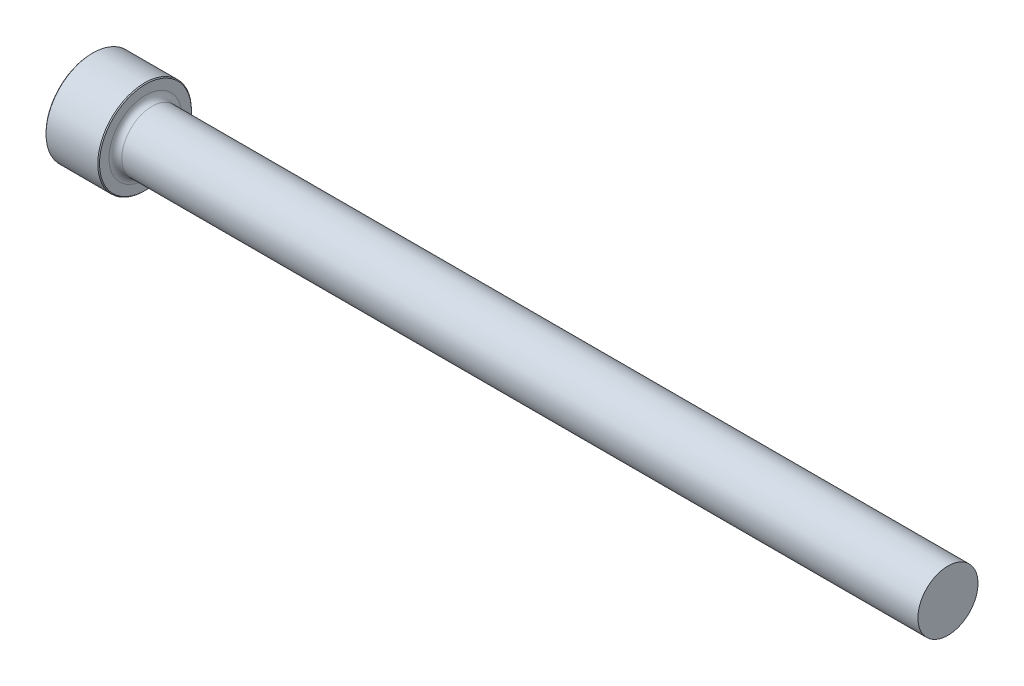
ISO-10303-21;
HEADER;
FILE_DESCRIPTION(('STEP AP214'),'2;1');
FILE_NAME('part.step','',(''),(''),'','','');
FILE_SCHEMA(('AUTOMOTIVE_DESIGN { 1 0 10303 214 1 1 1 1 }'));
ENDSEC;
DATA;
#1=APPLICATION_CONTEXT('core data for automotive mechanical design processes');
#2=APPLICATION_PROTOCOL_DEFINITION('international standard','automotive_design',2000,#1);
#3=PRODUCT_CONTEXT('',#1,'mechanical');
#4=PRODUCT('Part','Part','',(#3));
#5=PRODUCT_RELATED_PRODUCT_CATEGORY('part','',(#4));
#6=PRODUCT_DEFINITION_FORMATION('','',#4);
#7=PRODUCT_DEFINITION_CONTEXT('part definition',#1,'design');
#8=PRODUCT_DEFINITION('design','',#6,#7);
#9=PRODUCT_DEFINITION_SHAPE('','',#8);
#10=(LENGTH_UNIT() NAMED_UNIT(*) SI_UNIT(.MILLI.,.METRE.));
#11=(NAMED_UNIT(*) PLANE_ANGLE_UNIT() SI_UNIT($,.RADIAN.));
#12=(NAMED_UNIT(*) SI_UNIT($,.STERADIAN.) SOLID_ANGLE_UNIT());
#13=UNCERTAINTY_MEASURE_WITH_UNIT(LENGTH_MEASURE(1.E-05),#10,'distance_accuracy_value','');
#14=(GEOMETRIC_REPRESENTATION_CONTEXT(3) GLOBAL_UNCERTAINTY_ASSIGNED_CONTEXT((#13)) GLOBAL_UNIT_ASSIGNED_CONTEXT((#10,
#11,#12)) REPRESENTATION_CONTEXT('',''));
#15=CARTESIAN_POINT('',(0.,0.,0.));
#16=DIRECTION('',(0.,0.,1.));
#17=DIRECTION('',(1.,0.,0.));
#18=AXIS2_PLACEMENT_3D('',#15,#16,#17);
#19=CARTESIAN_POINT('',(101.6,3.56806499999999,0.));
#20=DIRECTION('',(1.,0.,0.));
#21=DIRECTION('',(0.,1.,0.));
#22=AXIS2_PLACEMENT_3D('',#19,#20,#21);
#23=PLANE('',#22);
#24=CARTESIAN_POINT('',(101.6,0.,0.));
#25=DIRECTION('',(1.,0.,0.));
#26=DIRECTION('',(0.,1.,0.));
#27=AXIS2_PLACEMENT_3D('',#24,#25,#26);
#28=CIRCLE('',#27,3.568065);
#29=CARTESIAN_POINT('',(101.6,3.56806499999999,0.));
#30=VERTEX_POINT('',#29);
#31=EDGE_CURVE('E50',#30,#30,#28,.T.);
#32=ORIENTED_EDGE('',*,*,#31,.T.);
#33=EDGE_LOOP('',(#32));
#34=FACE_BOUND('',#33,.T.);
#35=ADVANCED_FACE('F30',(#34),#23,.T.);
#36=CARTESIAN_POINT('',(101.6,0.,0.));
#37=DIRECTION('',(1.,0.,0.));
#38=DIRECTION('',(0.,1.,0.));
#39=AXIS2_PLACEMENT_3D('',#36,#37,#38);
#40=CYLINDRICAL_SURFACE('',#39,3.568065);
#41=CARTESIAN_POINT('',(7.11199999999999,0.,0.));
#42=DIRECTION('',(1.,0.,0.));
#43=DIRECTION('',(0.,1.,0.));
#44=AXIS2_PLACEMENT_3D('',#41,#42,#43);
#45=CIRCLE('',#44,3.56806499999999);
#46=CARTESIAN_POINT('',(7.11199999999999,3.56806499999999,0.));
#47=VERTEX_POINT('',#46);
#48=EDGE_CURVE('E53',#47,#47,#45,.T.);
#49=ORIENTED_EDGE('',*,*,#48,.T.);
#50=EDGE_LOOP('',(#49));
#51=FACE_BOUND('',#50,.T.);
#52=ORIENTED_EDGE('',*,*,#31,.F.);
#53=EDGE_LOOP('',(#52));
#54=FACE_BOUND('',#53,.T.);
#55=ADVANCED_FACE('F74',(#51,#54),#40,.T.);
#56=CARTESIAN_POINT('',(7.112,0.,0.));
#57=DIRECTION('',(1.,0.,0.));
#58=DIRECTION('',(0.,1.,0.));
#59=AXIS2_PLACEMENT_3D('',#56,#57,#58);
#60=TOROIDAL_SURFACE('',#59,4.33006499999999,0.762);
#61=CARTESIAN_POINT('',(6.34999999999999,0.,0.));
#62=DIRECTION('',(1.,0.,0.));
#63=DIRECTION('',(0.,1.,0.));
#64=AXIS2_PLACEMENT_3D('',#61,#62,#63);
#65=CIRCLE('',#64,4.33006499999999);
#66=CARTESIAN_POINT('',(6.34999999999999,4.33006499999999,0.));
#67=VERTEX_POINT('',#66);
#68=EDGE_CURVE('E56',#67,#67,#65,.T.);
#69=ORIENTED_EDGE('',*,*,#68,.T.);
#70=EDGE_LOOP('',(#69));
#71=FACE_BOUND('',#70,.T.);
#72=ORIENTED_EDGE('',*,*,#48,.F.);
#73=EDGE_LOOP('',(#72));
#74=FACE_BOUND('',#73,.T.);
#75=ADVANCED_FACE('F60',(#71,#74),#60,.F.);
#76=CARTESIAN_POINT('',(6.35,5.55625,0.));
#77=DIRECTION('',(1.,0.,0.));
#78=DIRECTION('',(0.,1.,0.));
#79=AXIS2_PLACEMENT_3D('',#76,#77,#78);
#80=PLANE('',#79);
#81=CARTESIAN_POINT('',(6.35,0.,0.));
#82=DIRECTION('',(1.,0.,0.));
#83=DIRECTION('',(0.,1.,0.));
#84=AXIS2_PLACEMENT_3D('',#81,#82,#83);
#85=CIRCLE('',#84,5.45465000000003);
#86=CARTESIAN_POINT('',(6.35,5.45465000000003,0.));
#87=VERTEX_POINT('',#86);
#88=EDGE_CURVE('E10',#87,#87,#85,.T.);
#89=ORIENTED_EDGE('',*,*,#88,.T.);
#90=EDGE_LOOP('',(#89));
#91=FACE_BOUND('',#90,.T.);
#92=ORIENTED_EDGE('',*,*,#68,.F.);
#93=EDGE_LOOP('',(#92));
#94=FACE_BOUND('',#93,.T.);
#95=ADVANCED_FACE('F63',(#91,#94),#80,.T.);
#96=CARTESIAN_POINT('',(101.6,0.,0.));
#97=DIRECTION('',(1.,0.,0.));
#98=DIRECTION('',(0.,1.,0.));
#99=AXIS2_PLACEMENT_3D('',#96,#97,#98);
#100=CYLINDRICAL_SURFACE('',#99,5.55625);
#101=CARTESIAN_POINT('',(0.101599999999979,0.,0.));
#102=DIRECTION('',(-1.,0.,0.));
#103=DIRECTION('',(0.,-1.,0.));
#104=AXIS2_PLACEMENT_3D('',#101,#102,#103);
#105=CIRCLE('',#104,5.55625);
#106=CARTESIAN_POINT('',(0.101599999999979,-5.55625,0.));
#107=VERTEX_POINT('',#106);
#108=EDGE_CURVE('E41',#107,#107,#105,.F.);
#109=ORIENTED_EDGE('',*,*,#108,.T.);
#110=EDGE_LOOP('',(#109));
#111=FACE_BOUND('',#110,.T.);
#112=CARTESIAN_POINT('',(6.24840000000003,0.,0.));
#113=DIRECTION('',(1.,0.,0.));
#114=DIRECTION('',(0.,1.,0.));
#115=AXIS2_PLACEMENT_3D('',#112,#113,#114);
#116=CIRCLE('',#115,5.55625);
#117=CARTESIAN_POINT('',(6.24840000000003,5.55625,0.));
#118=VERTEX_POINT('',#117);
#119=EDGE_CURVE('E45',#118,#118,#116,.F.);
#120=ORIENTED_EDGE('',*,*,#119,.T.);
#121=EDGE_LOOP('',(#120));
#122=FACE_BOUND('',#121,.T.);
#123=ADVANCED_FACE('F65',(#111,#122),#100,.T.);
#124=CARTESIAN_POINT('',(0.,0.,0.));
#125=DIRECTION('',(-1.,0.,0.));
#126=DIRECTION('',(0.,-1.,0.));
#127=AXIS2_PLACEMENT_3D('',#124,#125,#126);
#128=PLANE('',#127);
#129=CARTESIAN_POINT('',(0.,0.,0.));
#130=DIRECTION('',(-1.,0.,0.));
#131=DIRECTION('',(0.,-1.,0.));
#132=AXIS2_PLACEMENT_3D('',#129,#130,#131);
#133=CIRCLE('',#132,5.45465000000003);
#134=CARTESIAN_POINT('',(0.,-5.45465000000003,0.));
#135=VERTEX_POINT('',#134);
#136=EDGE_CURVE('E37',#135,#135,#133,.T.);
#137=ORIENTED_EDGE('',*,*,#136,.T.);
#138=EDGE_LOOP('',(#137));
#139=FACE_BOUND('',#138,.T.);
#140=ADVANCED_FACE('F71',(#139),#128,.T.);
#141=CARTESIAN_POINT('',(0.101599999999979,0.,0.));
#142=DIRECTION('',(1.,0.,0.));
#143=DIRECTION('',(0.,1.,0.));
#144=AXIS2_PLACEMENT_3D('',#141,#142,#143);
#145=CONICAL_SURFACE('',#144,5.55625,0.785398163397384);
#146=ORIENTED_EDGE('',*,*,#136,.F.);
#147=EDGE_LOOP('',(#146));
#148=FACE_BOUND('',#147,.T.);
#149=ORIENTED_EDGE('',*,*,#108,.F.);
#150=EDGE_LOOP('',(#149));
#151=FACE_BOUND('',#150,.T.);
#152=ADVANCED_FACE('F84',(#148,#151),#145,.T.);
#153=CARTESIAN_POINT('',(6.34999999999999,0.,0.));
#154=DIRECTION('',(-1.,0.,0.));
#155=DIRECTION('',(0.,-1.,0.));
#156=AXIS2_PLACEMENT_3D('',#153,#154,#155);
#157=CONICAL_SURFACE('',#156,5.45465000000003,0.785398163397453);
#158=ORIENTED_EDGE('',*,*,#119,.F.);
#159=EDGE_LOOP('',(#158));
#160=FACE_BOUND('',#159,.T.);
#161=ORIENTED_EDGE('',*,*,#88,.F.);
#162=EDGE_LOOP('',(#161));
#163=FACE_BOUND('',#162,.T.);
#164=ADVANCED_FACE('F32',(#160,#163),#157,.T.);
#165=CLOSED_SHELL('',(#35,#55,#75,#95,#123,#140,#152,#164));
#166=MANIFOLD_SOLID_BREP('B2',#165);
#167=ADVANCED_BREP_SHAPE_REPRESENTATION('',(#18,#166),#14);
#168=SHAPE_DEFINITION_REPRESENTATION(#9,#167);
ENDSEC;
END-ISO-10303-21;
